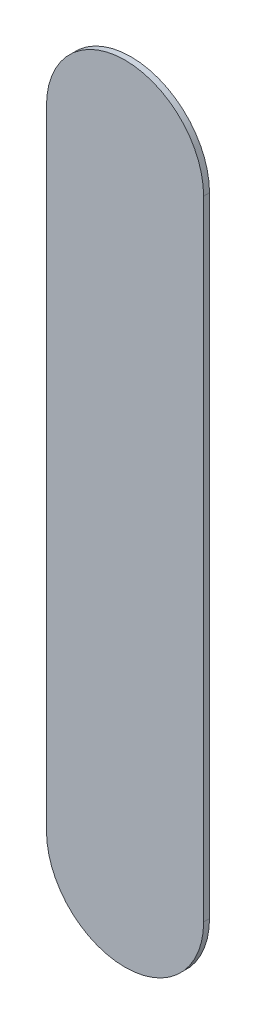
from build123d import *

# Parameters (mm, degrees)
BOSS_EXTRU_1_DEPTH = 3


with BuildPart() as part:
    # Esquisse1 → Boss.-Extru.1 (new body)
    with BuildSketch(Plane.XY):
        with BuildLine():
            Line((-40, 0), (-40, 320))
            ThreePointArc((-40, 320), (0, 360), (40, 320))
            Line((40, 320), (40, 0))
            ThreePointArc((40, 0), (0, -40), (-40, 0))
        make_face()
    extrude(amount=BOSS_EXTRU_1_DEPTH)


solid = part.part
